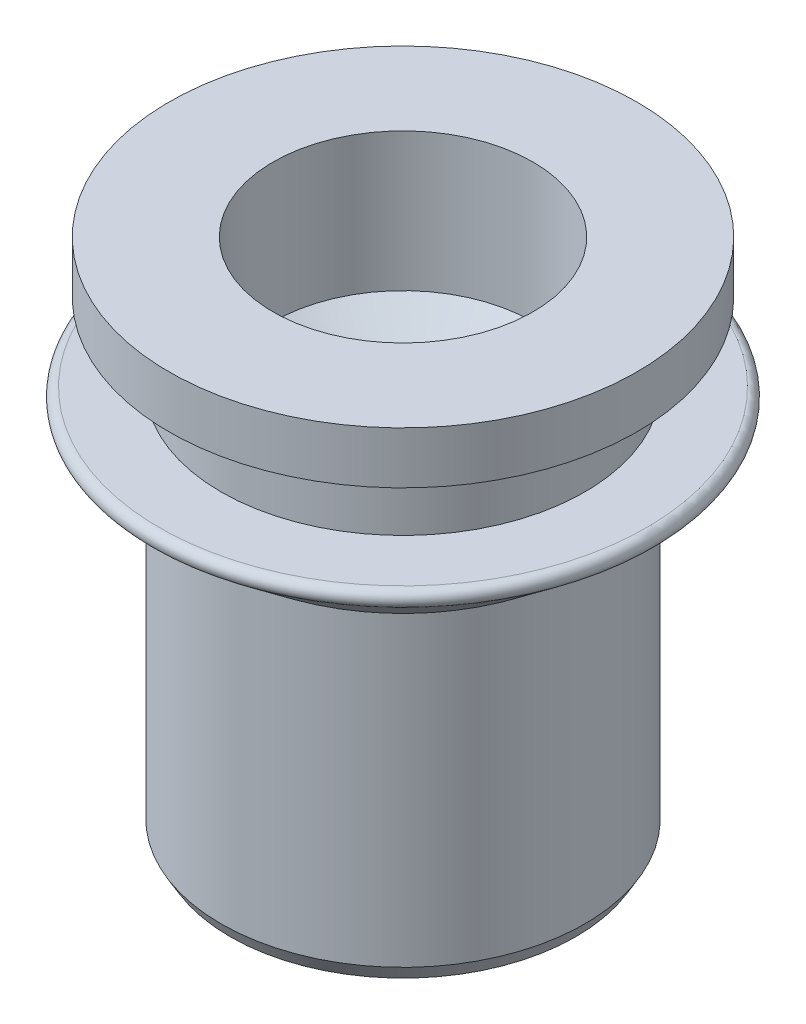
ISO-10303-21;
HEADER;
FILE_DESCRIPTION(('STEP AP214'),'2;1');
FILE_NAME('part.step','',(''),(''),'','','');
FILE_SCHEMA(('AUTOMOTIVE_DESIGN { 1 0 10303 214 1 1 1 1 }'));
ENDSEC;
DATA;
#1=APPLICATION_CONTEXT('core data for automotive mechanical design processes');
#2=APPLICATION_PROTOCOL_DEFINITION('international standard','automotive_design',2000,#1);
#3=PRODUCT_CONTEXT('',#1,'mechanical');
#4=PRODUCT('Part','Part','',(#3));
#5=PRODUCT_RELATED_PRODUCT_CATEGORY('part','',(#4));
#6=PRODUCT_DEFINITION_FORMATION('','',#4);
#7=PRODUCT_DEFINITION_CONTEXT('part definition',#1,'design');
#8=PRODUCT_DEFINITION('design','',#6,#7);
#9=PRODUCT_DEFINITION_SHAPE('','',#8);
#10=(LENGTH_UNIT() NAMED_UNIT(*) SI_UNIT(.MILLI.,.METRE.));
#11=(NAMED_UNIT(*) PLANE_ANGLE_UNIT() SI_UNIT($,.RADIAN.));
#12=(NAMED_UNIT(*) SI_UNIT($,.STERADIAN.) SOLID_ANGLE_UNIT());
#13=UNCERTAINTY_MEASURE_WITH_UNIT(LENGTH_MEASURE(1.E-05),#10,'distance_accuracy_value','');
#14=(GEOMETRIC_REPRESENTATION_CONTEXT(3) GLOBAL_UNCERTAINTY_ASSIGNED_CONTEXT((#13)) GLOBAL_UNIT_ASSIGNED_CONTEXT((#10,
#11,#12)) REPRESENTATION_CONTEXT('',''));
#15=CARTESIAN_POINT('',(0.,0.,0.));
#16=DIRECTION('',(0.,0.,1.));
#17=DIRECTION('',(1.,0.,0.));
#18=AXIS2_PLACEMENT_3D('',#15,#16,#17);
#19=CARTESIAN_POINT('',(0.,10.,0.));
#20=DIRECTION('',(0.,-1.,0.));
#21=DIRECTION('',(0.,0.,-1.));
#22=AXIS2_PLACEMENT_3D('',#19,#20,#21);
#23=PLANE('',#22);
#24=CARTESIAN_POINT('',(0.,10.,0.));
#25=DIRECTION('',(0.,-1.,0.));
#26=DIRECTION('',(0.,0.,-1.));
#27=AXIS2_PLACEMENT_3D('',#24,#25,#26);
#28=CIRCLE('',#27,4.5);
#29=CARTESIAN_POINT('',(0.,10.,-4.5));
#30=VERTEX_POINT('',#29);
#31=EDGE_CURVE('E65',#30,#30,#28,.T.);
#32=ORIENTED_EDGE('',*,*,#31,.F.);
#33=EDGE_LOOP('',(#32));
#34=FACE_BOUND('',#33,.T.);
#35=CARTESIAN_POINT('',(0.,10.,0.));
#36=DIRECTION('',(0.,-1.,0.));
#37=DIRECTION('',(0.,0.,-1.));
#38=AXIS2_PLACEMENT_3D('',#35,#36,#37);
#39=CIRCLE('',#38,2.5);
#40=CARTESIAN_POINT('',(0.,10.,-2.5));
#41=VERTEX_POINT('',#40);
#42=EDGE_CURVE('E18',#41,#41,#39,.F.);
#43=ORIENTED_EDGE('',*,*,#42,.F.);
#44=EDGE_LOOP('',(#43));
#45=FACE_BOUND('',#44,.T.);
#46=ADVANCED_FACE('F14',(#34,#45),#23,.F.);
#47=CARTESIAN_POINT('',(0.,-1.,0.));
#48=DIRECTION('',(0.,-1.,0.));
#49=DIRECTION('',(0.,0.,1.));
#50=AXIS2_PLACEMENT_3D('',#47,#48,#49);
#51=CYLINDRICAL_SURFACE('',#50,2.067);
#52=CARTESIAN_POINT('',(0.,0.432999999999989,0.));
#53=DIRECTION('',(0.,-1.,0.));
#54=DIRECTION('',(0.,0.,1.));
#55=AXIS2_PLACEMENT_3D('',#52,#53,#54);
#56=CIRCLE('',#55,2.067);
#57=CARTESIAN_POINT('',(0.,0.432999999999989,2.067));
#58=VERTEX_POINT('',#57);
#59=EDGE_CURVE('E62',#58,#58,#56,.T.);
#60=ORIENTED_EDGE('',*,*,#59,.T.);
#61=EDGE_LOOP('',(#60));
#62=FACE_BOUND('',#61,.T.);
#63=CARTESIAN_POINT('',(0.,5.41773462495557,0.));
#64=DIRECTION('',(0.,1.,0.));
#65=DIRECTION('',(0.,0.,1.));
#66=AXIS2_PLACEMENT_3D('',#63,#64,#65);
#67=CIRCLE('',#66,2.067);
#68=CARTESIAN_POINT('',(0.,5.41773462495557,2.067));
#69=VERTEX_POINT('',#68);
#70=EDGE_CURVE('E36',#69,#69,#67,.T.);
#71=ORIENTED_EDGE('',*,*,#70,.T.);
#72=EDGE_LOOP('',(#71));
#73=FACE_BOUND('',#72,.T.);
#74=ADVANCED_FACE('F116',(#62,#73),#51,.F.);
#75=CARTESIAN_POINT('',(0.,0.,0.));
#76=DIRECTION('',(0.,-1.,0.));
#77=DIRECTION('',(0.,0.,-1.));
#78=AXIS2_PLACEMENT_3D('',#75,#76,#77);
#79=PLANE('',#78);
#80=CARTESIAN_POINT('',(0.,0.,0.));
#81=DIRECTION('',(0.,-1.,0.));
#82=DIRECTION('',(0.,0.,-1.));
#83=AXIS2_PLACEMENT_3D('',#80,#81,#82);
#84=CIRCLE('',#83,3.325);
#85=CARTESIAN_POINT('',(0.,0.,-3.325));
#86=VERTEX_POINT('',#85);
#87=EDGE_CURVE('E10',#86,#86,#84,.T.);
#88=ORIENTED_EDGE('',*,*,#87,.T.);
#89=EDGE_LOOP('',(#88));
#90=FACE_BOUND('',#89,.T.);
#91=CARTESIAN_POINT('',(0.,0.,0.));
#92=DIRECTION('',(0.,-1.,0.));
#93=DIRECTION('',(0.,0.,1.));
#94=AXIS2_PLACEMENT_3D('',#91,#92,#93);
#95=CIRCLE('',#94,2.5);
#96=CARTESIAN_POINT('',(0.,0.,2.5));
#97=VERTEX_POINT('',#96);
#98=EDGE_CURVE('E46',#97,#97,#95,.T.);
#99=ORIENTED_EDGE('',*,*,#98,.F.);
#100=EDGE_LOOP('',(#99));
#101=FACE_BOUND('',#100,.T.);
#102=ADVANCED_FACE('F16',(#90,#101),#79,.T.);
#103=CARTESIAN_POINT('',(0.,0.,0.));
#104=DIRECTION('',(0.,1.,0.));
#105=DIRECTION('',(0.,0.,1.));
#106=AXIS2_PLACEMENT_3D('',#103,#104,#105);
#107=CONICAL_SURFACE('',#106,3.325,0.523598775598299);
#108=CARTESIAN_POINT('',(0.,0.303108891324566,0.));
#109=DIRECTION('',(0.,-1.,0.));
#110=DIRECTION('',(0.,0.,-1.));
#111=AXIS2_PLACEMENT_3D('',#108,#109,#110);
#112=CIRCLE('',#111,3.5);
#113=CARTESIAN_POINT('',(0.,0.303108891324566,-3.5));
#114=VERTEX_POINT('',#113);
#115=EDGE_CURVE('E23',#114,#114,#112,.T.);
#116=ORIENTED_EDGE('',*,*,#115,.T.);
#117=EDGE_LOOP('',(#116));
#118=FACE_BOUND('',#117,.T.);
#119=ORIENTED_EDGE('',*,*,#87,.F.);
#120=EDGE_LOOP('',(#119));
#121=FACE_BOUND('',#120,.T.);
#122=ADVANCED_FACE('F233',(#118,#121),#107,.T.);
#123=CARTESIAN_POINT('',(0.,0.,0.));
#124=DIRECTION('',(0.,-1.,0.));
#125=DIRECTION('',(0.,0.,-1.));
#126=AXIS2_PLACEMENT_3D('',#123,#124,#125);
#127=CYLINDRICAL_SURFACE('',#126,3.5);
#128=ORIENTED_EDGE('',*,*,#115,.F.);
#129=EDGE_LOOP('',(#128));
#130=FACE_BOUND('',#129,.T.);
#131=CARTESIAN_POINT('',(0.,6.20000000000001,0.));
#132=DIRECTION('',(0.,-1.,0.));
#133=DIRECTION('',(0.,0.,-1.));
#134=AXIS2_PLACEMENT_3D('',#131,#132,#133);
#135=CIRCLE('',#134,3.5);
#136=CARTESIAN_POINT('',(0.,6.20000000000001,-3.5));
#137=VERTEX_POINT('',#136);
#138=EDGE_CURVE('E33',#137,#137,#135,.T.);
#139=ORIENTED_EDGE('',*,*,#138,.T.);
#140=EDGE_LOOP('',(#139));
#141=FACE_BOUND('',#140,.T.);
#142=ADVANCED_FACE('F95',(#130,#141),#127,.T.);
#143=CARTESIAN_POINT('',(0.,7.2225951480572,0.));
#144=DIRECTION('',(0.,1.,0.));
#145=DIRECTION('',(0.,0.,1.));
#146=AXIS2_PLACEMENT_3D('',#143,#144,#145);
#147=CONICAL_SURFACE('',#146,4.80240485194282,0.90517039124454);
#148=ORIENTED_EDGE('',*,*,#138,.F.);
#149=EDGE_LOOP('',(#148));
#150=FACE_BOUND('',#149,.T.);
#151=CARTESIAN_POINT('',(0.,7.2225951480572,0.));
#152=DIRECTION('',(0.,-1.,0.));
#153=DIRECTION('',(0.,0.,-1.));
#154=AXIS2_PLACEMENT_3D('',#151,#152,#153);
#155=CIRCLE('',#154,4.80240485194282);
#156=CARTESIAN_POINT('',(0.,7.2225951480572,-4.80240485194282));
#157=VERTEX_POINT('',#156);
#158=EDGE_CURVE('E85',#157,#157,#155,.T.);
#159=ORIENTED_EDGE('',*,*,#158,.T.);
#160=EDGE_LOOP('',(#159));
#161=FACE_BOUND('',#160,.T.);
#162=ADVANCED_FACE('F97',(#150,#161),#147,.T.);
#163=CARTESIAN_POINT('',(0.,7.3375,0.));
#164=DIRECTION('',(0.,-1.,0.));
#165=DIRECTION('',(0.,0.,-1.));
#166=AXIS2_PLACEMENT_3D('',#163,#164,#165);
#167=TOROIDAL_SURFACE('',#166,4.6875,0.1625);
#168=CARTESIAN_POINT('',(0.,7.50000000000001,0.));
#169=DIRECTION('',(0.,-1.,0.));
#170=DIRECTION('',(0.,0.,-1.));
#171=AXIS2_PLACEMENT_3D('',#168,#169,#170);
#172=CIRCLE('',#171,4.6875);
#173=CARTESIAN_POINT('',(0.,7.50000000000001,-4.6875));
#174=VERTEX_POINT('',#173);
#175=EDGE_CURVE('E81',#174,#174,#172,.T.);
#176=ORIENTED_EDGE('',*,*,#175,.T.);
#177=EDGE_LOOP('',(#176));
#178=FACE_BOUND('',#177,.T.);
#179=ORIENTED_EDGE('',*,*,#158,.F.);
#180=EDGE_LOOP('',(#179));
#181=FACE_BOUND('',#180,.T.);
#182=ADVANCED_FACE('F100',(#178,#181),#167,.T.);
#183=CARTESIAN_POINT('',(3.5,7.49999999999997,0.));
#184=DIRECTION('',(0.,-1.,0.));
#185=DIRECTION('',(0.,0.,-1.));
#186=AXIS2_PLACEMENT_3D('',#183,#184,#185);
#187=PLANE('',#186);
#188=ORIENTED_EDGE('',*,*,#175,.F.);
#189=EDGE_LOOP('',(#188));
#190=FACE_BOUND('',#189,.T.);
#191=CARTESIAN_POINT('',(0.,7.50000000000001,0.));
#192=DIRECTION('',(0.,-1.,0.));
#193=DIRECTION('',(0.,0.,-1.));
#194=AXIS2_PLACEMENT_3D('',#191,#192,#193);
#195=CIRCLE('',#194,3.5);
#196=CARTESIAN_POINT('',(0.,7.50000000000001,-3.5));
#197=VERTEX_POINT('',#196);
#198=EDGE_CURVE('E77',#197,#197,#195,.T.);
#199=ORIENTED_EDGE('',*,*,#198,.T.);
#200=EDGE_LOOP('',(#199));
#201=FACE_BOUND('',#200,.T.);
#202=ADVANCED_FACE('F105',(#190,#201),#187,.F.);
#203=CARTESIAN_POINT('',(0.,0.,0.));
#204=DIRECTION('',(0.,-1.,0.));
#205=DIRECTION('',(0.,0.,-1.));
#206=AXIS2_PLACEMENT_3D('',#203,#204,#205);
#207=CYLINDRICAL_SURFACE('',#206,3.5);
#208=ORIENTED_EDGE('',*,*,#198,.F.);
#209=EDGE_LOOP('',(#208));
#210=FACE_BOUND('',#209,.T.);
#211=CARTESIAN_POINT('',(0.,9.00000000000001,0.));
#212=DIRECTION('',(0.,-1.,0.));
#213=DIRECTION('',(0.,0.,-1.));
#214=AXIS2_PLACEMENT_3D('',#211,#212,#213);
#215=CIRCLE('',#214,3.5);
#216=CARTESIAN_POINT('',(0.,9.00000000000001,-3.5));
#217=VERTEX_POINT('',#216);
#218=EDGE_CURVE('E73',#217,#217,#215,.T.);
#219=ORIENTED_EDGE('',*,*,#218,.T.);
#220=EDGE_LOOP('',(#219));
#221=FACE_BOUND('',#220,.T.);
#222=ADVANCED_FACE('F112',(#210,#221),#207,.T.);
#223=CARTESIAN_POINT('',(3.49999999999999,8.99999999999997,0.));
#224=DIRECTION('',(0.,-1.,0.));
#225=DIRECTION('',(0.,0.,-1.));
#226=AXIS2_PLACEMENT_3D('',#223,#224,#225);
#227=PLANE('',#226);
#228=CARTESIAN_POINT('',(0.,9.00000000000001,0.));
#229=DIRECTION('',(0.,-1.,0.));
#230=DIRECTION('',(0.,0.,-1.));
#231=AXIS2_PLACEMENT_3D('',#228,#229,#230);
#232=CIRCLE('',#231,4.5);
#233=CARTESIAN_POINT('',(0.,9.00000000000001,-4.5));
#234=VERTEX_POINT('',#233);
#235=EDGE_CURVE('E69',#234,#234,#232,.T.);
#236=ORIENTED_EDGE('',*,*,#235,.T.);
#237=EDGE_LOOP('',(#236));
#238=FACE_BOUND('',#237,.T.);
#239=ORIENTED_EDGE('',*,*,#218,.F.);
#240=EDGE_LOOP('',(#239));
#241=FACE_BOUND('',#240,.T.);
#242=ADVANCED_FACE('F132',(#238,#241),#227,.T.);
#243=CARTESIAN_POINT('',(0.,0.,0.));
#244=DIRECTION('',(0.,-1.,0.));
#245=DIRECTION('',(0.,0.,-1.));
#246=AXIS2_PLACEMENT_3D('',#243,#244,#245);
#247=CYLINDRICAL_SURFACE('',#246,4.5);
#248=ORIENTED_EDGE('',*,*,#235,.F.);
#249=EDGE_LOOP('',(#248));
#250=FACE_BOUND('',#249,.T.);
#251=ORIENTED_EDGE('',*,*,#31,.T.);
#252=EDGE_LOOP('',(#251));
#253=FACE_BOUND('',#252,.T.);
#254=ADVANCED_FACE('F128',(#250,#253),#247,.T.);
#255=CARTESIAN_POINT('',(0.,0.432999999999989,0.));
#256=DIRECTION('',(0.,-1.,0.));
#257=DIRECTION('',(0.,0.,1.));
#258=AXIS2_PLACEMENT_3D('',#255,#256,#257);
#259=CONICAL_SURFACE('',#258,2.067,0.785398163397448);
#260=ORIENTED_EDGE('',*,*,#98,.T.);
#261=EDGE_LOOP('',(#260));
#262=FACE_BOUND('',#261,.T.);
#263=ORIENTED_EDGE('',*,*,#59,.F.);
#264=EDGE_LOOP('',(#263));
#265=FACE_BOUND('',#264,.T.);
#266=ADVANCED_FACE('F131',(#262,#265),#259,.F.);
#267=CARTESIAN_POINT('',(0.,0.,0.));
#268=DIRECTION('',(0.,-1.,0.));
#269=DIRECTION('',(0.,0.,-1.));
#270=AXIS2_PLACEMENT_3D('',#267,#268,#269);
#271=CYLINDRICAL_SURFACE('',#270,2.5);
#272=CARTESIAN_POINT('',(0.,7.3375,0.));
#273=DIRECTION('',(0.,-1.,0.));
#274=DIRECTION('',(0.,0.,-1.));
#275=AXIS2_PLACEMENT_3D('',#272,#273,#274);
#276=CIRCLE('',#275,2.5);
#277=CARTESIAN_POINT('',(0.,7.3375,-2.5));
#278=VERTEX_POINT('',#277);
#279=EDGE_CURVE('E49',#278,#278,#276,.T.);
#280=ORIENTED_EDGE('',*,*,#279,.T.);
#281=EDGE_LOOP('',(#280));
#282=FACE_BOUND('',#281,.T.);
#283=ORIENTED_EDGE('',*,*,#42,.T.);
#284=EDGE_LOOP('',(#283));
#285=FACE_BOUND('',#284,.T.);
#286=ADVANCED_FACE('F167',(#282,#285),#271,.F.);
#287=CARTESIAN_POINT('',(0.,7.3375,0.));
#288=DIRECTION('',(0.,1.,0.));
#289=DIRECTION('',(0.,0.,1.));
#290=AXIS2_PLACEMENT_3D('',#287,#288,#289);
#291=CONICAL_SURFACE('',#290,4.365,0.874835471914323);
#292=ORIENTED_EDGE('',*,*,#70,.F.);
#293=EDGE_LOOP('',(#292));
#294=FACE_BOUND('',#293,.T.);
#295=CARTESIAN_POINT('',(0.,7.3375,0.));
#296=DIRECTION('',(0.,-1.,0.));
#297=DIRECTION('',(0.,0.,-1.));
#298=AXIS2_PLACEMENT_3D('',#295,#296,#297);
#299=CIRCLE('',#298,4.365);
#300=CARTESIAN_POINT('',(0.,7.3375,-4.365));
#301=VERTEX_POINT('',#300);
#302=EDGE_CURVE('E39',#301,#301,#299,.T.);
#303=ORIENTED_EDGE('',*,*,#302,.F.);
#304=EDGE_LOOP('',(#303));
#305=FACE_BOUND('',#304,.T.);
#306=ADVANCED_FACE('F175',(#294,#305),#291,.F.);
#307=CARTESIAN_POINT('',(2.49999999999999,7.33750000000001,0.));
#308=DIRECTION('',(0.,-1.,0.));
#309=DIRECTION('',(0.,0.,-1.));
#310=AXIS2_PLACEMENT_3D('',#307,#308,#309);
#311=PLANE('',#310);
#312=ORIENTED_EDGE('',*,*,#302,.T.);
#313=EDGE_LOOP('',(#312));
#314=FACE_BOUND('',#313,.T.);
#315=ORIENTED_EDGE('',*,*,#279,.F.);
#316=EDGE_LOOP('',(#315));
#317=FACE_BOUND('',#316,.T.);
#318=ADVANCED_FACE('F184',(#314,#317),#311,.T.);
#319=CLOSED_SHELL('',(#46,#74,#102,#122,#142,#162,#182,#202,#222,#242,#254,#266,#286,#306,#318));
#320=MANIFOLD_SOLID_BREP('B1',#319);
#321=ADVANCED_BREP_SHAPE_REPRESENTATION('',(#18,#320),#14);
#322=SHAPE_DEFINITION_REPRESENTATION(#9,#321);
ENDSEC;
END-ISO-10303-21;
